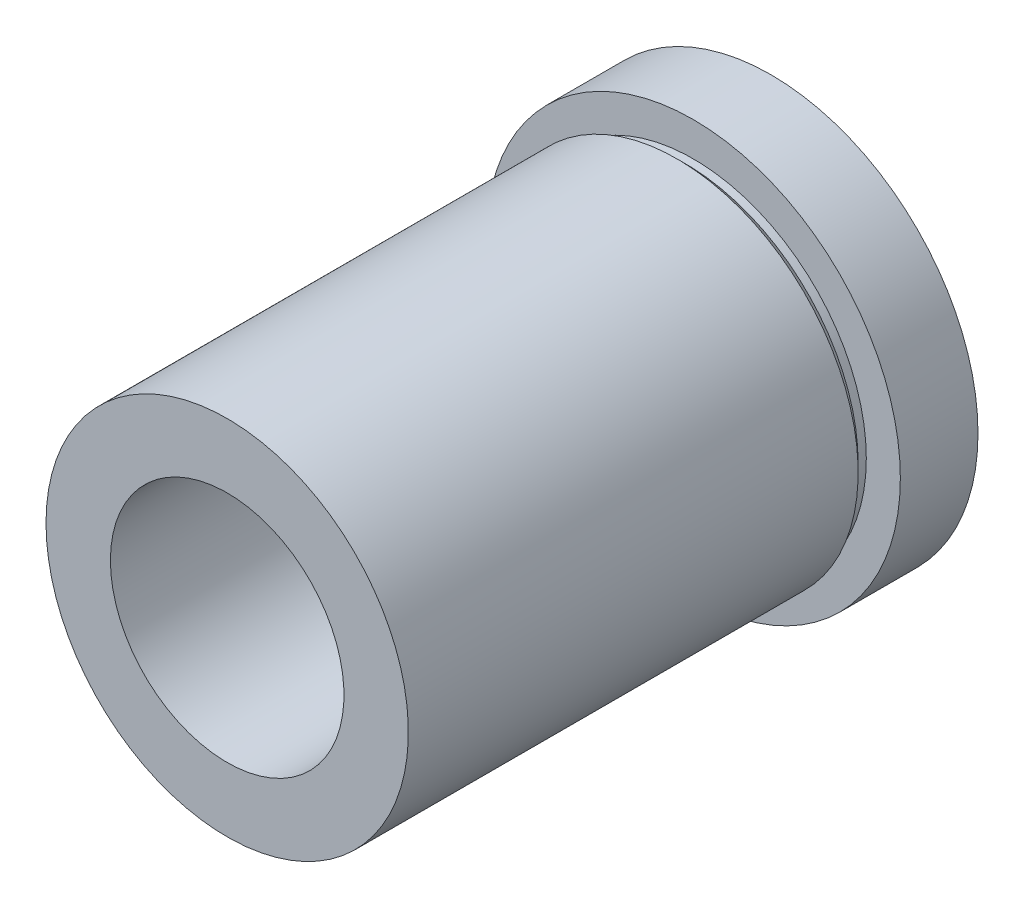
ISO-10303-21;
HEADER;
FILE_DESCRIPTION(('STEP AP214'),'2;1');
FILE_NAME('part.step','',(''),(''),'','','');
FILE_SCHEMA(('AUTOMOTIVE_DESIGN { 1 0 10303 214 1 1 1 1 }'));
ENDSEC;
DATA;
#1=APPLICATION_CONTEXT('core data for automotive mechanical design processes');
#2=APPLICATION_PROTOCOL_DEFINITION('international standard','automotive_design',2000,#1);
#3=PRODUCT_CONTEXT('',#1,'mechanical');
#4=PRODUCT('Part','Part','',(#3));
#5=PRODUCT_RELATED_PRODUCT_CATEGORY('part','',(#4));
#6=PRODUCT_DEFINITION_FORMATION('','',#4);
#7=PRODUCT_DEFINITION_CONTEXT('part definition',#1,'design');
#8=PRODUCT_DEFINITION('design','',#6,#7);
#9=PRODUCT_DEFINITION_SHAPE('','',#8);
#10=(LENGTH_UNIT() NAMED_UNIT(*) SI_UNIT(.MILLI.,.METRE.));
#11=(NAMED_UNIT(*) PLANE_ANGLE_UNIT() SI_UNIT($,.RADIAN.));
#12=(NAMED_UNIT(*) SI_UNIT($,.STERADIAN.) SOLID_ANGLE_UNIT());
#13=UNCERTAINTY_MEASURE_WITH_UNIT(LENGTH_MEASURE(1.E-05),#10,'distance_accuracy_value','');
#14=(GEOMETRIC_REPRESENTATION_CONTEXT(3) GLOBAL_UNCERTAINTY_ASSIGNED_CONTEXT((#13)) GLOBAL_UNIT_ASSIGNED_CONTEXT((#10,
#11,#12)) REPRESENTATION_CONTEXT('',''));
#15=CARTESIAN_POINT('',(0.,0.,0.));
#16=DIRECTION('',(0.,0.,1.));
#17=DIRECTION('',(1.,0.,0.));
#18=AXIS2_PLACEMENT_3D('',#15,#16,#17);
#19=CARTESIAN_POINT('',(-12.7,0.,-4.7625));
#20=DIRECTION('',(0.,0.,1.));
#21=DIRECTION('',(1.,0.,0.));
#22=AXIS2_PLACEMENT_3D('',#19,#20,#21);
#23=PLANE('',#22);
#24=CARTESIAN_POINT('',(0.,0.,-4.7625));
#25=DIRECTION('',(0.,0.,-1.));
#26=DIRECTION('',(-1.,0.,0.));
#27=AXIS2_PLACEMENT_3D('',#24,#25,#26);
#28=CIRCLE('',#27,7.1628);
#29=CARTESIAN_POINT('',(-7.1628,0.,-4.7625));
#30=VERTEX_POINT('',#29);
#31=EDGE_CURVE('E10',#30,#30,#28,.T.);
#32=ORIENTED_EDGE('',*,*,#31,.F.);
#33=EDGE_LOOP('',(#32));
#34=FACE_BOUND('',#33,.T.);
#35=CARTESIAN_POINT('',(0.,0.,-4.7625));
#36=DIRECTION('',(0.,0.,-1.));
#37=DIRECTION('',(-1.,0.,0.));
#38=AXIS2_PLACEMENT_3D('',#35,#36,#37);
#39=CIRCLE('',#38,12.7);
#40=CARTESIAN_POINT('',(-12.7,0.,-4.7625));
#41=VERTEX_POINT('',#40);
#42=EDGE_CURVE('E78',#41,#41,#39,.T.);
#43=ORIENTED_EDGE('',*,*,#42,.T.);
#44=EDGE_LOOP('',(#43));
#45=FACE_BOUND('',#44,.T.);
#46=ADVANCED_FACE('F41',(#34,#45),#23,.F.);
#47=CARTESIAN_POINT('',(0.,0.,-41.5372037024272));
#48=DIRECTION('',(0.,0.,-1.));
#49=DIRECTION('',(-1.,0.,0.));
#50=AXIS2_PLACEMENT_3D('',#47,#48,#49);
#51=CYLINDRICAL_SURFACE('',#50,7.1628);
#52=CARTESIAN_POINT('',(0.,0.,28.5873698));
#53=DIRECTION('',(0.,0.,-1.));
#54=DIRECTION('',(-1.,0.,0.));
#55=AXIS2_PLACEMENT_3D('',#52,#53,#54);
#56=CIRCLE('',#55,7.1628);
#57=CARTESIAN_POINT('',(-7.16280000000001,0.,28.5873698));
#58=VERTEX_POINT('',#57);
#59=EDGE_CURVE('E48',#58,#58,#56,.T.);
#60=ORIENTED_EDGE('',*,*,#59,.F.);
#61=EDGE_LOOP('',(#60));
#62=FACE_BOUND('',#61,.T.);
#63=ORIENTED_EDGE('',*,*,#31,.T.);
#64=EDGE_LOOP('',(#63));
#65=FACE_BOUND('',#64,.T.);
#66=ADVANCED_FACE('F117',(#62,#65),#51,.F.);
#67=CARTESIAN_POINT('',(-7.16280000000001,0.,28.5873698));
#68=DIRECTION('',(0.,0.,-1.));
#69=DIRECTION('',(-1.,0.,0.));
#70=AXIS2_PLACEMENT_3D('',#67,#68,#69);
#71=PLANE('',#70);
#72=CARTESIAN_POINT('',(0.,0.,28.5873698));
#73=DIRECTION('',(0.,0.,-1.));
#74=DIRECTION('',(-1.,0.,0.));
#75=AXIS2_PLACEMENT_3D('',#72,#73,#74);
#76=CIRCLE('',#75,11.1125);
#77=CARTESIAN_POINT('',(-11.1125,0.,28.5873698));
#78=VERTEX_POINT('',#77);
#79=EDGE_CURVE('E54',#78,#78,#76,.T.);
#80=ORIENTED_EDGE('',*,*,#79,.F.);
#81=EDGE_LOOP('',(#80));
#82=FACE_BOUND('',#81,.T.);
#83=ORIENTED_EDGE('',*,*,#59,.T.);
#84=EDGE_LOOP('',(#83));
#85=FACE_BOUND('',#84,.T.);
#86=ADVANCED_FACE('F112',(#82,#85),#71,.F.);
#87=CARTESIAN_POINT('',(0.,0.,-41.5372037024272));
#88=DIRECTION('',(0.,0.,-1.));
#89=DIRECTION('',(-1.,0.,0.));
#90=AXIS2_PLACEMENT_3D('',#87,#88,#89);
#91=CYLINDRICAL_SURFACE('',#90,11.1125);
#92=CARTESIAN_POINT('',(0.,0.,1.));
#93=DIRECTION('',(0.,0.,-1.));
#94=DIRECTION('',(-1.,0.,0.));
#95=AXIS2_PLACEMENT_3D('',#92,#93,#94);
#96=CIRCLE('',#95,11.1125);
#97=CARTESIAN_POINT('',(-11.1125,0.,1.));
#98=VERTEX_POINT('',#97);
#99=EDGE_CURVE('E60',#98,#98,#96,.T.);
#100=ORIENTED_EDGE('',*,*,#99,.F.);
#101=EDGE_LOOP('',(#100));
#102=FACE_BOUND('',#101,.T.);
#103=ORIENTED_EDGE('',*,*,#79,.T.);
#104=EDGE_LOOP('',(#103));
#105=FACE_BOUND('',#104,.T.);
#106=ADVANCED_FACE('F106',(#102,#105),#91,.T.);
#107=CARTESIAN_POINT('',(0.,0.,1.));
#108=DIRECTION('',(0.,0.,1.));
#109=DIRECTION('',(1.,0.,0.));
#110=AXIS2_PLACEMENT_3D('',#107,#108,#109);
#111=CONICAL_SURFACE('',#110,11.1125,0.78539816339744);
#112=CARTESIAN_POINT('',(0.,0.,0.499999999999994));
#113=DIRECTION('',(0.,0.,-1.));
#114=DIRECTION('',(-1.,0.,0.));
#115=AXIS2_PLACEMENT_3D('',#112,#113,#114);
#116=CIRCLE('',#115,10.6125);
#117=CARTESIAN_POINT('',(-10.6125,0.,0.499999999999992));
#118=VERTEX_POINT('',#117);
#119=EDGE_CURVE('E66',#118,#118,#116,.T.);
#120=ORIENTED_EDGE('',*,*,#119,.F.);
#121=EDGE_LOOP('',(#120));
#122=FACE_BOUND('',#121,.T.);
#123=ORIENTED_EDGE('',*,*,#99,.T.);
#124=EDGE_LOOP('',(#123));
#125=FACE_BOUND('',#124,.T.);
#126=ADVANCED_FACE('F100',(#122,#125),#111,.T.);
#127=CARTESIAN_POINT('',(0.,0.,-41.5372037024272));
#128=DIRECTION('',(0.,0.,-1.));
#129=DIRECTION('',(-1.,0.,0.));
#130=AXIS2_PLACEMENT_3D('',#127,#128,#129);
#131=CYLINDRICAL_SURFACE('',#130,10.6125);
#132=CARTESIAN_POINT('',(0.,0.,0.));
#133=DIRECTION('',(0.,0.,-1.));
#134=DIRECTION('',(-1.,0.,0.));
#135=AXIS2_PLACEMENT_3D('',#132,#133,#134);
#136=CIRCLE('',#135,10.6125);
#137=CARTESIAN_POINT('',(-10.6125,0.,0.));
#138=VERTEX_POINT('',#137);
#139=EDGE_CURVE('E70',#138,#138,#136,.T.);
#140=ORIENTED_EDGE('',*,*,#139,.F.);
#141=EDGE_LOOP('',(#140));
#142=FACE_BOUND('',#141,.T.);
#143=ORIENTED_EDGE('',*,*,#119,.T.);
#144=EDGE_LOOP('',(#143));
#145=FACE_BOUND('',#144,.T.);
#146=ADVANCED_FACE('F94',(#142,#145),#131,.T.);
#147=CARTESIAN_POINT('',(-10.6125,0.,0.));
#148=DIRECTION('',(0.,0.,-1.));
#149=DIRECTION('',(-1.,0.,0.));
#150=AXIS2_PLACEMENT_3D('',#147,#148,#149);
#151=PLANE('',#150);
#152=CARTESIAN_POINT('',(0.,0.,0.));
#153=DIRECTION('',(0.,0.,-1.));
#154=DIRECTION('',(-1.,0.,0.));
#155=AXIS2_PLACEMENT_3D('',#152,#153,#154);
#156=CIRCLE('',#155,12.7);
#157=CARTESIAN_POINT('',(-12.7,0.,0.));
#158=VERTEX_POINT('',#157);
#159=EDGE_CURVE('E74',#158,#158,#156,.T.);
#160=ORIENTED_EDGE('',*,*,#159,.F.);
#161=EDGE_LOOP('',(#160));
#162=FACE_BOUND('',#161,.T.);
#163=ORIENTED_EDGE('',*,*,#139,.T.);
#164=EDGE_LOOP('',(#163));
#165=FACE_BOUND('',#164,.T.);
#166=ADVANCED_FACE('F88',(#162,#165),#151,.F.);
#167=CARTESIAN_POINT('',(0.,0.,-41.5372037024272));
#168=DIRECTION('',(0.,0.,-1.));
#169=DIRECTION('',(-1.,0.,0.));
#170=AXIS2_PLACEMENT_3D('',#167,#168,#169);
#171=CYLINDRICAL_SURFACE('',#170,12.7);
#172=ORIENTED_EDGE('',*,*,#42,.F.);
#173=EDGE_LOOP('',(#172));
#174=FACE_BOUND('',#173,.T.);
#175=ORIENTED_EDGE('',*,*,#159,.T.);
#176=EDGE_LOOP('',(#175));
#177=FACE_BOUND('',#176,.T.);
#178=ADVANCED_FACE('F85',(#174,#177),#171,.T.);
#179=CLOSED_SHELL('',(#46,#66,#86,#106,#126,#146,#166,#178));
#180=MANIFOLD_SOLID_BREP('B2',#179);
#181=ADVANCED_BREP_SHAPE_REPRESENTATION('',(#18,#180),#14);
#182=SHAPE_DEFINITION_REPRESENTATION(#9,#181);
ENDSEC;
END-ISO-10303-21;
